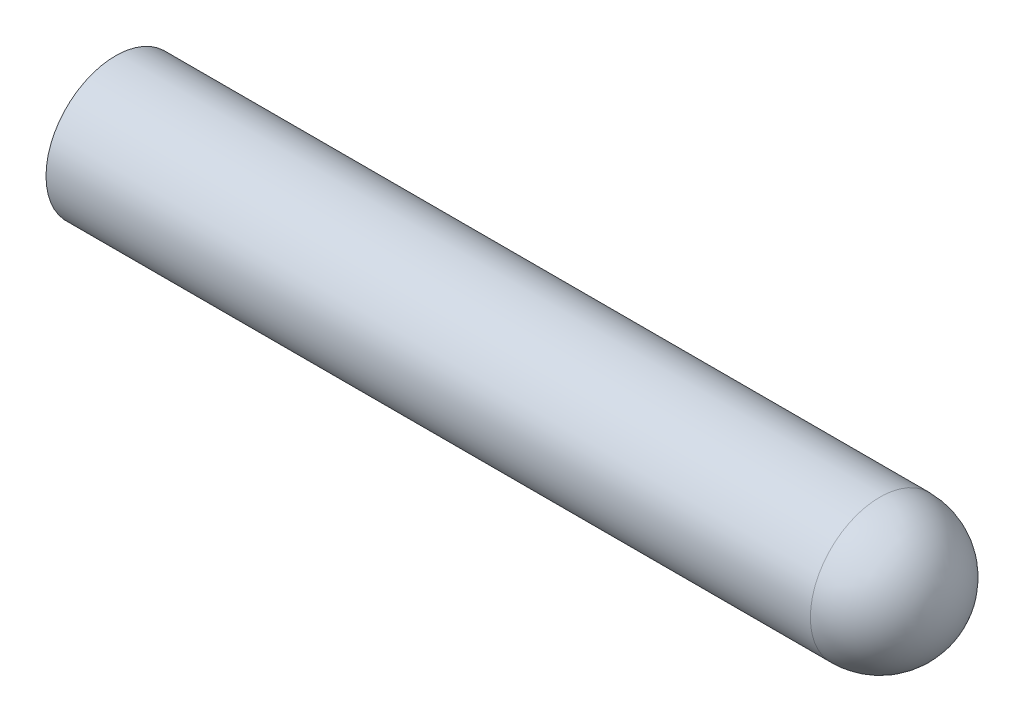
ISO-10303-21;
HEADER;
FILE_DESCRIPTION(('STEP AP214'),'2;1');
FILE_NAME('part.step','',(''),(''),'','','');
FILE_SCHEMA(('AUTOMOTIVE_DESIGN { 1 0 10303 214 1 1 1 1 }'));
ENDSEC;
DATA;
#1=APPLICATION_CONTEXT('core data for automotive mechanical design processes');
#2=APPLICATION_PROTOCOL_DEFINITION('international standard','automotive_design',2000,#1);
#3=PRODUCT_CONTEXT('',#1,'mechanical');
#4=PRODUCT('Part','Part','',(#3));
#5=PRODUCT_RELATED_PRODUCT_CATEGORY('part','',(#4));
#6=PRODUCT_DEFINITION_FORMATION('','',#4);
#7=PRODUCT_DEFINITION_CONTEXT('part definition',#1,'design');
#8=PRODUCT_DEFINITION('design','',#6,#7);
#9=PRODUCT_DEFINITION_SHAPE('','',#8);
#10=(LENGTH_UNIT() NAMED_UNIT(*) SI_UNIT(.MILLI.,.METRE.));
#11=(NAMED_UNIT(*) PLANE_ANGLE_UNIT() SI_UNIT($,.RADIAN.));
#12=(NAMED_UNIT(*) SI_UNIT($,.STERADIAN.) SOLID_ANGLE_UNIT());
#13=UNCERTAINTY_MEASURE_WITH_UNIT(LENGTH_MEASURE(1.E-05),#10,'distance_accuracy_value','');
#14=(GEOMETRIC_REPRESENTATION_CONTEXT(3) GLOBAL_UNCERTAINTY_ASSIGNED_CONTEXT((#13)) GLOBAL_UNIT_ASSIGNED_CONTEXT((#10,
#11,#12)) REPRESENTATION_CONTEXT('',''));
#15=CARTESIAN_POINT('',(0.,0.,0.));
#16=DIRECTION('',(0.,0.,1.));
#17=DIRECTION('',(1.,0.,0.));
#18=AXIS2_PLACEMENT_3D('',#15,#16,#17);
#19=CARTESIAN_POINT('',(0.,0.,0.));
#20=DIRECTION('',(1.,0.,0.));
#21=DIRECTION('',(0.,0.,-1.));
#22=AXIS2_PLACEMENT_3D('',#19,#20,#21);
#23=PLANE('',#22);
#24=CARTESIAN_POINT('',(0.,0.,0.));
#25=DIRECTION('',(-1.,0.,0.));
#26=DIRECTION('',(0.,0.,1.));
#27=AXIS2_PLACEMENT_3D('',#24,#25,#26);
#28=CIRCLE('',#27,5.);
#29=CARTESIAN_POINT('',(0.,0.,5.));
#30=VERTEX_POINT('',#29);
#31=EDGE_CURVE('E35',#30,#30,#28,.T.);
#32=ORIENTED_EDGE('',*,*,#31,.T.);
#33=EDGE_LOOP('',(#32));
#34=FACE_BOUND('',#33,.T.);
#35=ADVANCED_FACE('F29',(#34),#23,.F.);
#36=CARTESIAN_POINT('',(55.,0.,0.));
#37=DIRECTION('',(-1.,0.,0.));
#38=DIRECTION('',(0.,-1.,0.));
#39=AXIS2_PLACEMENT_3D('',#36,#37,#38);
#40=SPHERICAL_SURFACE('',#39,4.99999999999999);
#41=CARTESIAN_POINT('',(55.,0.,0.));
#42=DIRECTION('',(-1.,0.,0.));
#43=DIRECTION('',(0.,0.,1.));
#44=AXIS2_PLACEMENT_3D('',#41,#42,#43);
#45=CIRCLE('',#44,5.);
#46=CARTESIAN_POINT('',(55.,0.,5.));
#47=VERTEX_POINT('',#46);
#48=EDGE_CURVE('E10',#47,#47,#45,.T.);
#49=ORIENTED_EDGE('',*,*,#48,.F.);
#50=EDGE_LOOP('',(#49));
#51=FACE_BOUND('',#50,.T.);
#52=ADVANCED_FACE('F44',(#51),#40,.T.);
#53=CARTESIAN_POINT('',(0.,0.,0.));
#54=DIRECTION('',(-1.,0.,0.));
#55=DIRECTION('',(0.,0.,1.));
#56=AXIS2_PLACEMENT_3D('',#53,#54,#55);
#57=CYLINDRICAL_SURFACE('',#56,5.);
#58=ORIENTED_EDGE('',*,*,#31,.F.);
#59=EDGE_LOOP('',(#58));
#60=FACE_BOUND('',#59,.T.);
#61=ORIENTED_EDGE('',*,*,#48,.T.);
#62=EDGE_LOOP('',(#61));
#63=FACE_BOUND('',#62,.T.);
#64=ADVANCED_FACE('F42',(#60,#63),#57,.T.);
#65=CLOSED_SHELL('',(#35,#52,#64));
#66=MANIFOLD_SOLID_BREP('B2',#65);
#67=ADVANCED_BREP_SHAPE_REPRESENTATION('',(#18,#66),#14);
#68=SHAPE_DEFINITION_REPRESENTATION(#9,#67);
ENDSEC;
END-ISO-10303-21;
